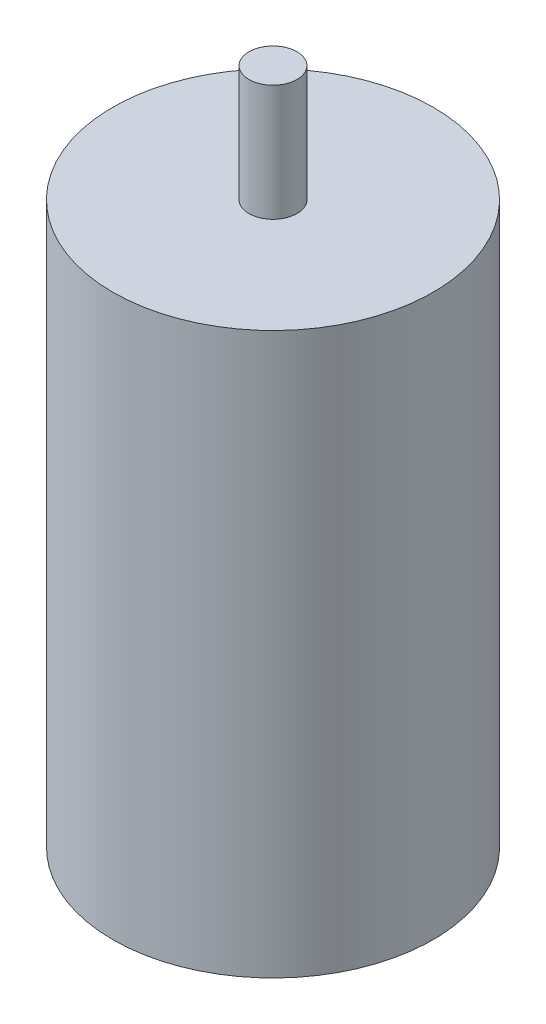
from build123d import *

# Parameters (mm, degrees)
SKETCH1_R      = 20
EXTRUDE1_DEPTH = 70
SKETCH4_R      = 3
EXTRUDE2_DEPTH = 14.5


with BuildPart() as part:
    # Sketch1 → Extrude1 (new body)
    with BuildSketch(Plane(origin=(0, 0, 0), x_dir=(1, 0, 0), z_dir=(0, 1, 0))):
        with Locations(Location((0, 0, 0), (0, 0, 270))):
            Circle(SKETCH1_R)
    extrude(amount=EXTRUDE1_DEPTH)

    # Sketch4 → Extrude2 (add)
    with BuildSketch(Plane(origin=(0, 70, 0), x_dir=(-1, 0, 0), z_dir=(0, 1, 0))):
        with Locations(Location((0, 0, 0), (0, 0, 270))):
            Circle(SKETCH4_R)
    extrude(amount=EXTRUDE2_DEPTH)


solid = part.part
